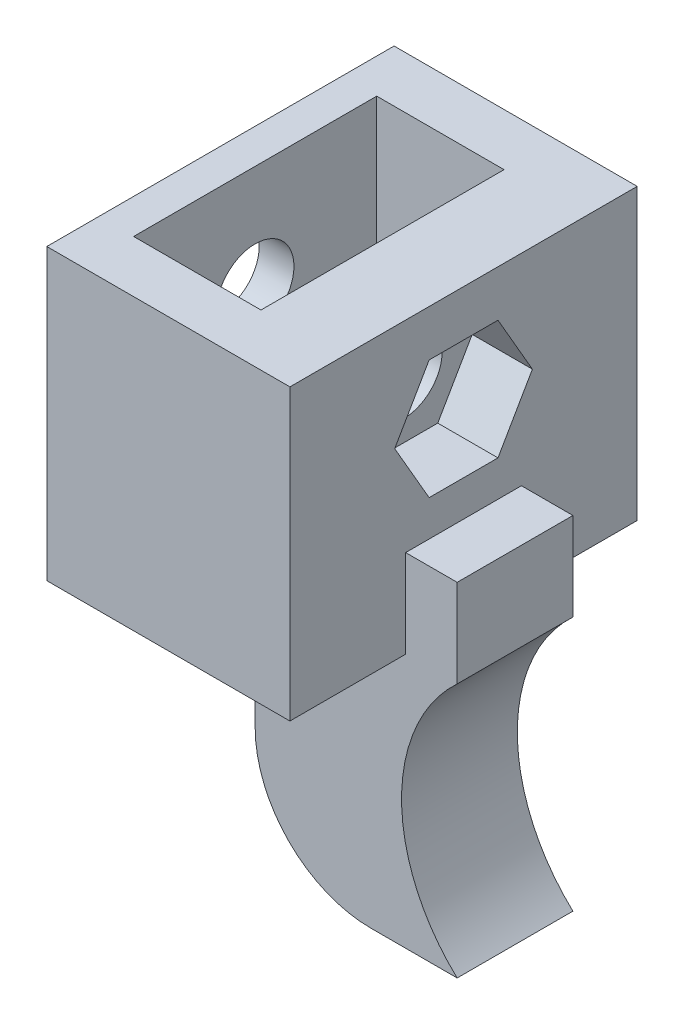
from build123d import *

# Parameters (mm, degrees)
BOSS_EXTRUDE1_DEPTH     = 15
SKETCH3_W               = 11
SKETCH3_H               = 21
CUT_EXTRUDE1_DEPTH      = 18.3
CUT_EXTRUDE7_REACH      = 61.355
SKETCH7_W               = 25.447843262
SKETCH7_H               = 10
CUT_EXTRUDE5_DEPTH      = 66.04250386
CUT_EXTRUDE5_DEPTH_BACK = 66.04250386
SKETCH13_R              = 3.35
CUT_EXTRUDE6_DEPTH      = 5.2
SKETCH15_W              = 4.447843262
SKETCH15_H              = 10
CUT_EXTRUDE8_DEPTH      = 7.601822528


with BuildPart() as part:
    # Sketch2 → Boss-Extrude1 (new, symmetric)
    with BuildSketch(Plane.XY):
        with BuildLine():
            Line((-33, -12.174501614), (-12, -12.174501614))
            Line((-12, -12.174501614), (-12, -29.572679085))
            Line((-12, -29.572679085), (-7.552156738, -29.572679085))
            Line((-7.552156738, -29.572679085), (-7.552156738, -37.174501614))
            ThreePointArc((-7.552156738, -37.174501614), (-12.354117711, -48.174501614), (-7.552156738, -59.174501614))
            Line((-7.552156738, -59.174501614), (-15, -59.174501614))
            ThreePointArc((-15, -59.174501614), (-22.071067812, -56.245569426), (-25, -49.174501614))
            Line((-25, -49.174501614), (-25, -37.174501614))
            Line((-25, -37.174501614), (-33, -37.174501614))
            Line((-33, -37.174501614), (-33, -12.174501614))
        make_face()
    extrude(amount=BOSS_EXTRUDE1_DEPTH, both=True)

    # Sketch3 → Cut-Extrude1 (cut)
    with BuildSketch(Plane(origin=(0, -12.174501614, 0), x_dir=(1, 0, 0), z_dir=(0, 1, 0))):
        with Locations((-24.5, 0)):
            Rectangle(SKETCH3_W, SKETCH3_H)
    extrude(amount=-CUT_EXTRUDE1_DEPTH, mode=Mode.SUBTRACT)

    # Cut-Extrude7: up to this face of the body (flat: up to its plane)
    cut_extrude7_end = Plane(part.part.faces().sort_by_distance((-29, -37.174501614, 0))[0])
    # Sketch7 → Cut-Extrude7 (cut, up to the picked face)
    with BuildSketch(Plane.XZ.offset(59.174501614), mode=Mode.PRIVATE) as cut_extrude7_sk1:
        with Locations((-20.276078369, 10)):
            Rectangle(SKETCH7_W, SKETCH7_H)
    cut_extrude7_tool1 = split(extrude(cut_extrude7_sk1.sketch, amount=-CUT_EXTRUDE7_REACH, mode=Mode.PRIVATE), bisect_by=cut_extrude7_end, keep=Keep.BOTH, mode=Mode.PRIVATE)
    # Sketch7 → Cut-Extrude7 (cut, up to the picked face)
    with BuildSketch(Plane.XZ.offset(59.174501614), mode=Mode.PRIVATE) as cut_extrude7_sk2:
        with Locations((-20.276078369, -10)):
            Rectangle(SKETCH7_W, SKETCH7_H)
    cut_extrude7_tool2 = split(extrude(cut_extrude7_sk2.sketch, amount=-CUT_EXTRUDE7_REACH, mode=Mode.PRIVATE), bisect_by=cut_extrude7_end, keep=Keep.BOTH, mode=Mode.PRIVATE)
    add(cut_extrude7_tool1.solids().sort_by(Axis((-20.276078, -59.174502, 10), (0, 1, 0)))[0], mode=Mode.SUBTRACT)
    add(cut_extrude7_tool2.solids().sort_by(Axis((-20.276078, -59.174502, -10), (0, 1, 0)))[0], mode=Mode.SUBTRACT)

    # Sketch13 → Cut-Extrude5 (cut, two sides: drawn at the far end of the back side and taken through both)
    with BuildSketch(Plane(origin=(-30, 0, 0), x_dir=(0, 0, -1), z_dir=(1, 0, 0)).offset(-CUT_EXTRUDE5_DEPTH_BACK)):
        with Locations((0, -21.324501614)):
            Circle(SKETCH13_R)
    extrude(amount=CUT_EXTRUDE5_DEPTH + CUT_EXTRUDE5_DEPTH_BACK, mode=Mode.SUBTRACT)

    # Sketch14 → Cut-Extrude6 (cut)
    with BuildSketch(Plane(origin=(-12, 0, 0), x_dir=(0, 0, -1), z_dir=(1, 0, 0))):
        Polygon((5.946707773, -21.324501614), (2.973353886, -16.174501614), (-2.973353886, -16.174501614), (-5.946707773, -21.324501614), (-2.973353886, -26.474501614), (2.973353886, -26.474501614), align=None)
    extrude(amount=-CUT_EXTRUDE6_DEPTH, mode=Mode.SUBTRACT)

    # Sketch15 → Cut-Extrude8 (cut)
    with BuildSketch(Plane(origin=(0, -29.572679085, 0), x_dir=(1, 0, 0), z_dir=(0, 1, 0))):
        with Locations((-9.776078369, 10)):
            Rectangle(SKETCH15_W, SKETCH15_H)
        with Locations((-9.776078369, -10)):
            Rectangle(SKETCH15_W, SKETCH15_H)
    extrude(amount=-CUT_EXTRUDE8_DEPTH, mode=Mode.SUBTRACT)


solid = part.part
